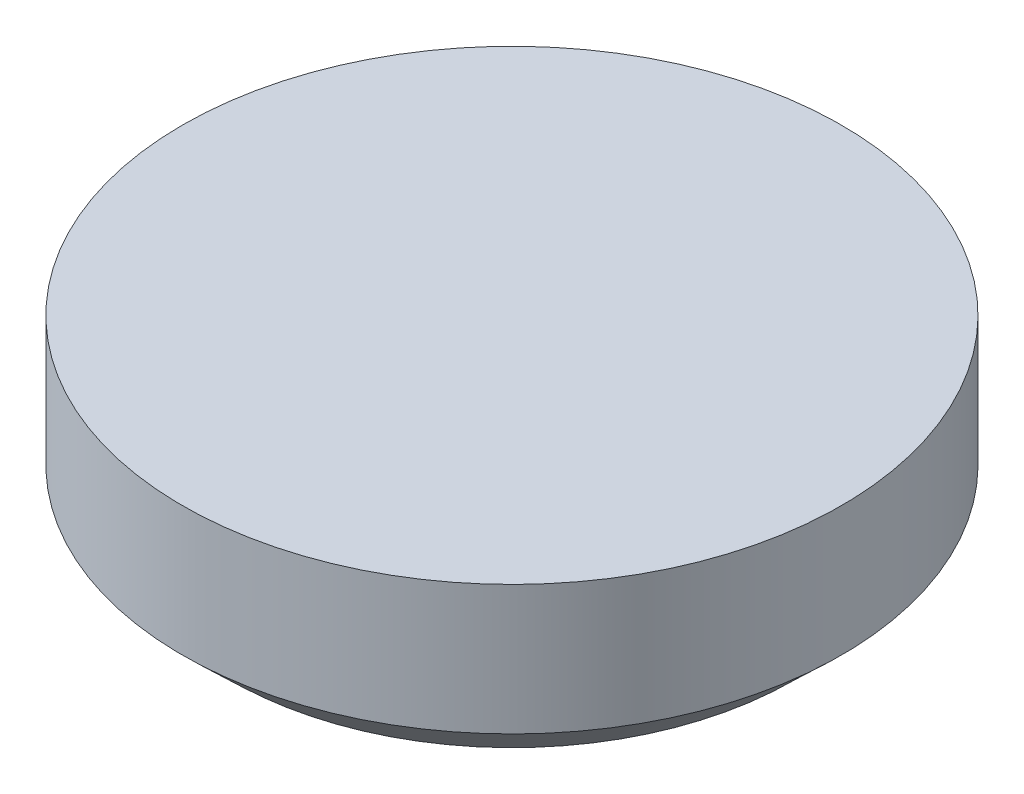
ISO-10303-21;
HEADER;
FILE_DESCRIPTION(('STEP AP214'),'2;1');
FILE_NAME('part.step','',(''),(''),'','','');
FILE_SCHEMA(('AUTOMOTIVE_DESIGN { 1 0 10303 214 1 1 1 1 }'));
ENDSEC;
DATA;
#1=APPLICATION_CONTEXT('core data for automotive mechanical design processes');
#2=APPLICATION_PROTOCOL_DEFINITION('international standard','automotive_design',2000,#1);
#3=PRODUCT_CONTEXT('',#1,'mechanical');
#4=PRODUCT('Part','Part','',(#3));
#5=PRODUCT_RELATED_PRODUCT_CATEGORY('part','',(#4));
#6=PRODUCT_DEFINITION_FORMATION('','',#4);
#7=PRODUCT_DEFINITION_CONTEXT('part definition',#1,'design');
#8=PRODUCT_DEFINITION('design','',#6,#7);
#9=PRODUCT_DEFINITION_SHAPE('','',#8);
#10=(LENGTH_UNIT() NAMED_UNIT(*) SI_UNIT(.MILLI.,.METRE.));
#11=(NAMED_UNIT(*) PLANE_ANGLE_UNIT() SI_UNIT($,.RADIAN.));
#12=(NAMED_UNIT(*) SI_UNIT($,.STERADIAN.) SOLID_ANGLE_UNIT());
#13=UNCERTAINTY_MEASURE_WITH_UNIT(LENGTH_MEASURE(1.E-05),#10,'distance_accuracy_value','');
#14=(GEOMETRIC_REPRESENTATION_CONTEXT(3) GLOBAL_UNCERTAINTY_ASSIGNED_CONTEXT((#13)) GLOBAL_UNIT_ASSIGNED_CONTEXT((#10,
#11,#12)) REPRESENTATION_CONTEXT('',''));
#15=CARTESIAN_POINT('',(0.,0.,0.));
#16=DIRECTION('',(0.,0.,1.));
#17=DIRECTION('',(1.,0.,0.));
#18=AXIS2_PLACEMENT_3D('',#15,#16,#17);
#19=CARTESIAN_POINT('',(-68.0895732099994,146.758302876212,0.));
#20=DIRECTION('',(0.,-1.,0.));
#21=DIRECTION('',(1.,0.,0.));
#22=AXIS2_PLACEMENT_3D('',#19,#20,#21);
#23=PLANE('',#22);
#24=CARTESIAN_POINT('',(-68.0895732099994,146.758302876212,0.));
#25=DIRECTION('',(0.,1.,0.));
#26=DIRECTION('',(-1.,0.,0.));
#27=AXIS2_PLACEMENT_3D('',#24,#25,#26);
#28=CIRCLE('',#27,565.);
#29=CARTESIAN_POINT('',(-633.089573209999,146.758302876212,0.));
#30=VERTEX_POINT('',#29);
#31=EDGE_CURVE('E9',#30,#30,#28,.T.);
#32=ORIENTED_EDGE('',*,*,#31,.T.);
#33=EDGE_LOOP('',(#32));
#34=FACE_BOUND('',#33,.T.);
#35=ADVANCED_FACE('F13',(#34),#23,.F.);
#36=CARTESIAN_POINT('',(-68.0895732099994,146.758302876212,0.));
#37=DIRECTION('',(0.,1.,0.));
#38=DIRECTION('',(-1.,0.,0.));
#39=AXIS2_PLACEMENT_3D('',#36,#37,#38);
#40=CYLINDRICAL_SURFACE('',#39,565.);
#41=ORIENTED_EDGE('',*,*,#31,.F.);
#42=EDGE_LOOP('',(#41));
#43=FACE_BOUND('',#42,.T.);
#44=CARTESIAN_POINT('',(-68.0895732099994,-75.2416971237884,0.));
#45=DIRECTION('',(0.,1.,0.));
#46=DIRECTION('',(-1.,0.,0.));
#47=AXIS2_PLACEMENT_3D('',#44,#45,#46);
#48=CIRCLE('',#47,565.);
#49=CARTESIAN_POINT('',(-633.089573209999,-75.2416971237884,0.));
#50=VERTEX_POINT('',#49);
#51=EDGE_CURVE('E19',#50,#50,#48,.T.);
#52=ORIENTED_EDGE('',*,*,#51,.T.);
#53=EDGE_LOOP('',(#52));
#54=FACE_BOUND('',#53,.T.);
#55=ADVANCED_FACE('F39',(#43,#54),#40,.T.);
#56=CARTESIAN_POINT('',(-68.0895732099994,-153.241697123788,0.));
#57=DIRECTION('',(0.,1.,0.));
#58=DIRECTION('',(-1.,0.,0.));
#59=AXIS2_PLACEMENT_3D('',#56,#57,#58);
#60=CONICAL_SURFACE('',#59,483.5,0.807338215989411);
#61=ORIENTED_EDGE('',*,*,#51,.F.);
#62=EDGE_LOOP('',(#61));
#63=FACE_BOUND('',#62,.T.);
#64=CARTESIAN_POINT('',(-68.0895732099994,-153.241697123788,0.));
#65=DIRECTION('',(0.,1.,0.));
#66=DIRECTION('',(-1.,0.,0.));
#67=AXIS2_PLACEMENT_3D('',#64,#65,#66);
#68=CIRCLE('',#67,483.5);
#69=CARTESIAN_POINT('',(-551.589573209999,-153.241697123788,0.));
#70=VERTEX_POINT('',#69);
#71=EDGE_CURVE('E23',#70,#70,#68,.T.);
#72=ORIENTED_EDGE('',*,*,#71,.T.);
#73=EDGE_LOOP('',(#72));
#74=FACE_BOUND('',#73,.T.);
#75=ADVANCED_FACE('F30',(#63,#74),#60,.T.);
#76=CARTESIAN_POINT('',(415.410426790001,-153.241697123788,0.));
#77=DIRECTION('',(0.,1.,0.));
#78=DIRECTION('',(-1.,0.,0.));
#79=AXIS2_PLACEMENT_3D('',#76,#77,#78);
#80=PLANE('',#79);
#81=ORIENTED_EDGE('',*,*,#71,.F.);
#82=EDGE_LOOP('',(#81));
#83=FACE_BOUND('',#82,.T.);
#84=ADVANCED_FACE('F32',(#83),#80,.F.);
#85=CLOSED_SHELL('',(#35,#55,#75,#84));
#86=MANIFOLD_SOLID_BREP('B1',#85);
#87=ADVANCED_BREP_SHAPE_REPRESENTATION('',(#18,#86),#14);
#88=SHAPE_DEFINITION_REPRESENTATION(#9,#87);
ENDSEC;
END-ISO-10303-21;
